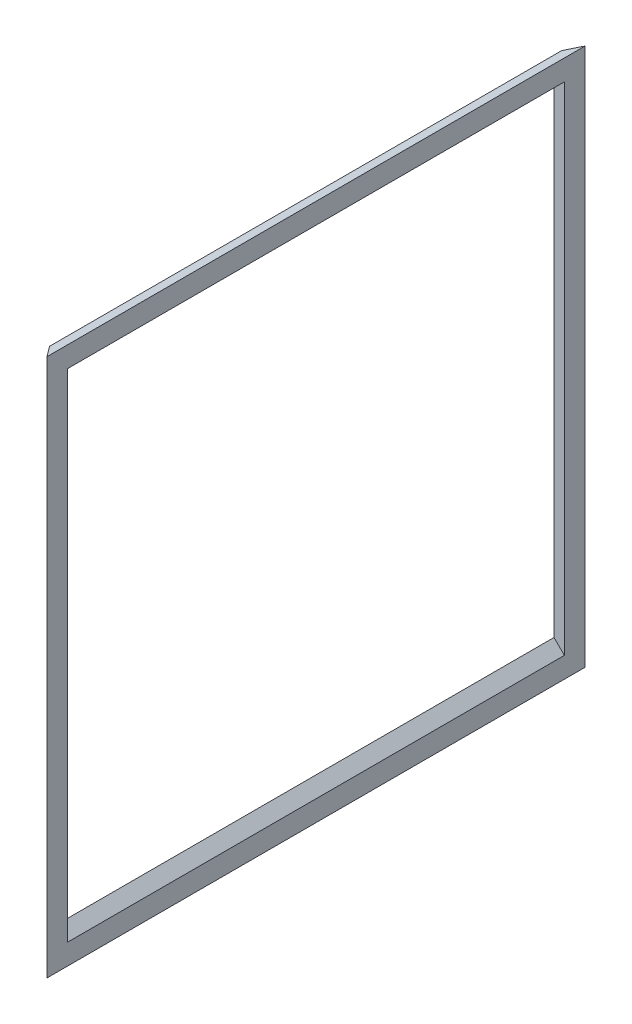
from build123d import *


with BuildPart() as part:
    # Sketch1 → Gap_bridge_0 section 0
    with BuildSketch(Plane.YZ):
        with BuildLine():
            Line((-75.3872, 76.2), (81.7372, 76.2))
            Line((81.7372, 76.2), (81.7372, 78.5622))
            Line((81.7372, 78.5622), (-75.3872, 78.5622))
            Line((-75.3872, 78.5622), (-75.3872, 76.2))
        make_face()
    # Sketch2 → Gap_bridge_0 section 1
    with BuildSketch(Plane.YZ.offset(3.175)):
        with BuildLine():
            Line((-82.55, 76.2), (82.55, 76.2))
            Line((82.55, 76.2), (82.55, 82.55))
            Line((82.55, 82.55), (-82.55, 82.55))
            Line((-82.55, 82.55), (-82.55, 76.2))
        make_face()
    loft()


with BuildPart() as body_2:
    # Sketch3 → Gap_bridge_1 section 0
    with BuildSketch(Plane.YZ):
        with BuildLine():
            Line((-75.3872, -78.5622), (81.7372, -78.5622))
            Line((81.7372, -78.5622), (81.7372, -76.2))
            Line((81.7372, -76.2), (-75.3872, -76.2))
            Line((-75.3872, -76.2), (-75.3872, -78.5622))
        make_face()
    # Sketch4 → Gap_bridge_1 section 1
    with BuildSketch(Plane.YZ.offset(3.175)):
        with BuildLine():
            Line((-82.55, -82.55), (82.55, -82.55))
            Line((82.55, -82.55), (82.55, -76.2))
            Line((82.55, -76.2), (-82.55, -76.2))
            Line((-82.55, -76.2), (-82.55, -82.55))
        make_face()
    loft()


with BuildPart() as part_1:
    add(part.part)

    add(body_2.part)  # Gap_bridge_2 merges body 2
    # Sketch5 → Gap_bridge_2 section 0
    with BuildSketch(Plane.YZ):
        with BuildLine():
            Line((79.375, -76.2), (81.7372, -76.2))
            Line((81.7372, -76.2), (81.7372, 76.2))
            Line((81.7372, 76.2), (79.375, 76.2))
            Line((79.375, 76.2), (79.375, -76.2))
        make_face()
    # Sketch6 → Gap_bridge_2 section 1
    with BuildSketch(Plane.YZ.offset(3.175)):
        with BuildLine():
            Line((76.2, -76.2), (82.55, -76.2))
            Line((82.55, -76.2), (82.55, 76.2))
            Line((82.55, 76.2), (76.2, 76.2))
            Line((76.2, 76.2), (76.2, -76.2))
        make_face()
    loft()

    # Sketch7 → Gap_bridge_3 section 0
    with BuildSketch(Plane.YZ):
        with BuildLine():
            Line((-75.3872, -76.2), (-73.025, -76.2))
            Line((-73.025, -76.2), (-73.025, 76.2))
            Line((-73.025, 76.2), (-75.3872, 76.2))
            Line((-75.3872, 76.2), (-75.3872, -76.2))
        make_face()
    # Sketch8 → Gap_bridge_3 section 1
    with BuildSketch(Plane.YZ.offset(3.175)):
        with BuildLine():
            Line((-82.55, -76.2), (-76.2, -76.2))
            Line((-76.2, -76.2), (-76.2, 76.2))
            Line((-76.2, 76.2), (-82.55, 76.2))
            Line((-82.55, 76.2), (-82.55, -76.2))
        make_face()
    loft()


solid = part_1.part
